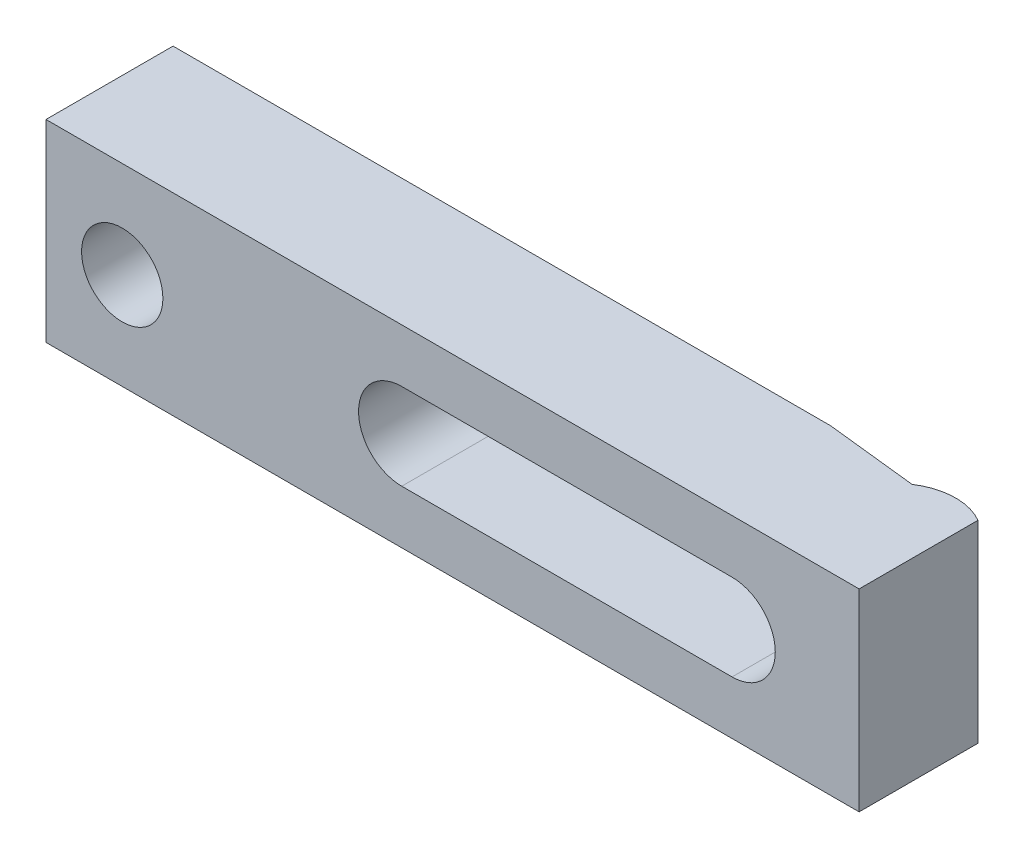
ISO-10303-21;
HEADER;
FILE_DESCRIPTION(('STEP AP214'),'2;1');
FILE_NAME('part.step','',(''),(''),'','','');
FILE_SCHEMA(('AUTOMOTIVE_DESIGN { 1 0 10303 214 1 1 1 1 }'));
ENDSEC;
DATA;
#1=APPLICATION_CONTEXT('core data for automotive mechanical design processes');
#2=APPLICATION_PROTOCOL_DEFINITION('international standard','automotive_design',2000,#1);
#3=PRODUCT_CONTEXT('',#1,'mechanical');
#4=PRODUCT('Part','Part','',(#3));
#5=PRODUCT_RELATED_PRODUCT_CATEGORY('part','',(#4));
#6=PRODUCT_DEFINITION_FORMATION('','',#4);
#7=PRODUCT_DEFINITION_CONTEXT('part definition',#1,'design');
#8=PRODUCT_DEFINITION('design','',#6,#7);
#9=PRODUCT_DEFINITION_SHAPE('','',#8);
#10=(LENGTH_UNIT() NAMED_UNIT(*) SI_UNIT(.MILLI.,.METRE.));
#11=(NAMED_UNIT(*) PLANE_ANGLE_UNIT() SI_UNIT($,.RADIAN.));
#12=(NAMED_UNIT(*) SI_UNIT($,.STERADIAN.) SOLID_ANGLE_UNIT());
#13=UNCERTAINTY_MEASURE_WITH_UNIT(LENGTH_MEASURE(1.E-05),#10,'distance_accuracy_value','');
#14=(GEOMETRIC_REPRESENTATION_CONTEXT(3) GLOBAL_UNCERTAINTY_ASSIGNED_CONTEXT((#13)) GLOBAL_UNIT_ASSIGNED_CONTEXT((#10,
#11,#12)) REPRESENTATION_CONTEXT('',''));
#15=CARTESIAN_POINT('',(0.,0.,0.));
#16=DIRECTION('',(0.,0.,1.));
#17=DIRECTION('',(1.,0.,0.));
#18=AXIS2_PLACEMENT_3D('',#15,#16,#17);
#19=CARTESIAN_POINT('',(-135.,19.,0.));
#20=DIRECTION('',(0.,0.,-1.));
#21=DIRECTION('',(-1.,0.,0.));
#22=AXIS2_PLACEMENT_3D('',#19,#20,#21);
#23=PLANE('',#22);
#24=DIRECTION('',(1.,0.,0.));
#25=VECTOR('',#24,1.);
#26=CARTESIAN_POINT('',(-65.,8.5,0.));
#27=LINE('',#26,#25);
#28=CARTESIAN_POINT('',(-135.,8.5,0.));
#29=VERTEX_POINT('',#28);
#30=CARTESIAN_POINT('',(-5.6,8.5,0.));
#31=VERTEX_POINT('',#30);
#32=EDGE_CURVE('E122',#29,#31,#27,.T.);
#33=ORIENTED_EDGE('',*,*,#32,.F.);
#34=DIRECTION('',(0.,-1.,0.));
#35=VECTOR('',#34,1.);
#36=CARTESIAN_POINT('',(-135.,19.,0.));
#37=LINE('',#36,#35);
#38=CARTESIAN_POINT('',(-135.,19.,0.));
#39=VERTEX_POINT('',#38);
#40=EDGE_CURVE('E139',#39,#29,#37,.T.);
#41=ORIENTED_EDGE('',*,*,#40,.F.);
#42=DIRECTION('',(1.,0.,0.));
#43=VECTOR('',#42,1.);
#44=CARTESIAN_POINT('',(-135.,19.,0.));
#45=LINE('',#44,#43);
#46=CARTESIAN_POINT('',(-5.6,19.,0.));
#47=VERTEX_POINT('',#46);
#48=EDGE_CURVE('E196',#39,#47,#45,.T.);
#49=ORIENTED_EDGE('',*,*,#48,.T.);
#50=DIRECTION('',(0.,-1.,0.));
#51=VECTOR('',#50,1.);
#52=CARTESIAN_POINT('',(-5.6,19.,0.));
#53=LINE('',#52,#51);
#54=EDGE_CURVE('E147',#47,#31,#53,.T.);
#55=ORIENTED_EDGE('',*,*,#54,.T.);
#56=EDGE_LOOP('',(#33,#41,#49,#55));
#57=FACE_BOUND('',#56,.T.);
#58=ADVANCED_FACE('F14',(#57),#23,.T.);
#59=CARTESIAN_POINT('',(-135.,19.,25.));
#60=DIRECTION('',(-1.,0.,0.));
#61=DIRECTION('',(0.,0.,1.));
#62=AXIS2_PLACEMENT_3D('',#59,#60,#61);
#63=PLANE('',#62);
#64=ORIENTED_EDGE('',*,*,#40,.T.);
#65=DIRECTION('',(0.,0.,1.));
#66=VECTOR('',#65,1.);
#67=CARTESIAN_POINT('',(-135.,8.5,25.));
#68=LINE('',#67,#66);
#69=CARTESIAN_POINT('',(-135.,8.5,5.));
#70=VERTEX_POINT('',#69);
#71=EDGE_CURVE('E133',#29,#70,#68,.T.);
#72=ORIENTED_EDGE('',*,*,#71,.T.);
#73=DIRECTION('',(0.,-1.,0.));
#74=VECTOR('',#73,1.);
#75=CARTESIAN_POINT('',(-135.,19.,5.));
#76=LINE('',#75,#74);
#77=CARTESIAN_POINT('',(-135.,-8.5,5.));
#78=VERTEX_POINT('',#77);
#79=EDGE_CURVE('E132',#70,#78,#76,.T.);
#80=ORIENTED_EDGE('',*,*,#79,.T.);
#81=DIRECTION('',(0.,0.,1.));
#82=VECTOR('',#81,1.);
#83=CARTESIAN_POINT('',(-135.,-8.5,25.));
#84=LINE('',#83,#82);
#85=CARTESIAN_POINT('',(-135.,-8.5,0.));
#86=VERTEX_POINT('',#85);
#87=EDGE_CURVE('E113',#86,#78,#84,.T.);
#88=ORIENTED_EDGE('',*,*,#87,.F.);
#89=CARTESIAN_POINT('',(-135.,-19.,0.));
#90=VERTEX_POINT('',#89);
#91=EDGE_CURVE('E129',#86,#90,#37,.T.);
#92=ORIENTED_EDGE('',*,*,#91,.T.);
#93=DIRECTION('',(0.,0.,-1.));
#94=VECTOR('',#93,1.);
#95=CARTESIAN_POINT('',(-135.,-19.,25.));
#96=LINE('',#95,#94);
#97=CARTESIAN_POINT('',(-135.,-19.,25.));
#98=VERTEX_POINT('',#97);
#99=EDGE_CURVE('E169',#98,#90,#96,.T.);
#100=ORIENTED_EDGE('',*,*,#99,.F.);
#101=DIRECTION('',(0.,-1.,0.));
#102=VECTOR('',#101,1.);
#103=CARTESIAN_POINT('',(-135.,19.,25.));
#104=LINE('',#103,#102);
#105=CARTESIAN_POINT('',(-135.,19.,25.));
#106=VERTEX_POINT('',#105);
#107=EDGE_CURVE('E140',#106,#98,#104,.T.);
#108=ORIENTED_EDGE('',*,*,#107,.F.);
#109=DIRECTION('',(0.,0.,-1.));
#110=VECTOR('',#109,1.);
#111=CARTESIAN_POINT('',(-135.,19.,25.));
#112=LINE('',#111,#110);
#113=EDGE_CURVE('E179',#106,#39,#112,.T.);
#114=ORIENTED_EDGE('',*,*,#113,.T.);
#115=EDGE_LOOP('',(#64,#72,#80,#88,#92,#100,#108,#114));
#116=FACE_BOUND('',#115,.T.);
#117=ADVANCED_FACE('F127',(#116),#63,.T.);
#118=CARTESIAN_POINT('',(-65.,0.,25.));
#119=DIRECTION('',(0.,0.,-1.));
#120=DIRECTION('',(-1.,0.,0.));
#121=AXIS2_PLACEMENT_3D('',#118,#119,#120);
#122=CYLINDRICAL_SURFACE('',#121,8.5);
#123=DIRECTION('',(0.,0.,-1.));
#124=VECTOR('',#123,1.);
#125=CARTESIAN_POINT('',(-65.,-8.5,25.));
#126=LINE('',#125,#124);
#127=CARTESIAN_POINT('',(-65.,-8.5,25.));
#128=VERTEX_POINT('',#127);
#129=CARTESIAN_POINT('',(-65.,-8.5,5.));
#130=VERTEX_POINT('',#129);
#131=EDGE_CURVE('E229',#128,#130,#126,.T.);
#132=ORIENTED_EDGE('',*,*,#131,.T.);
#133=CARTESIAN_POINT('',(-65.,0.,5.));
#134=DIRECTION('',(0.,0.,-1.));
#135=DIRECTION('',(-1.,0.,0.));
#136=AXIS2_PLACEMENT_3D('',#133,#134,#135);
#137=CIRCLE('',#136,8.5);
#138=CARTESIAN_POINT('',(-65.,8.5,5.));
#139=VERTEX_POINT('',#138);
#140=EDGE_CURVE('E245',#130,#139,#137,.T.);
#141=ORIENTED_EDGE('',*,*,#140,.T.);
#142=DIRECTION('',(0.,0.,-1.));
#143=VECTOR('',#142,1.);
#144=CARTESIAN_POINT('',(-65.,8.5,25.));
#145=LINE('',#144,#143);
#146=CARTESIAN_POINT('',(-65.,8.5,25.));
#147=VERTEX_POINT('',#146);
#148=EDGE_CURVE('E231',#147,#139,#145,.T.);
#149=ORIENTED_EDGE('',*,*,#148,.F.);
#150=CARTESIAN_POINT('',(-65.,0.,25.));
#151=DIRECTION('',(0.,0.,1.));
#152=DIRECTION('',(1.,0.,0.));
#153=AXIS2_PLACEMENT_3D('',#150,#151,#152);
#154=CIRCLE('',#153,8.5);
#155=EDGE_CURVE('E38',#147,#128,#154,.T.);
#156=ORIENTED_EDGE('',*,*,#155,.T.);
#157=EDGE_LOOP('',(#132,#141,#149,#156));
#158=FACE_BOUND('',#157,.T.);
#159=ADVANCED_FACE('F244',(#158),#122,.F.);
#160=CARTESIAN_POINT('',(-120.,0.,25.));
#161=DIRECTION('',(0.,0.,-1.));
#162=DIRECTION('',(-1.,0.,0.));
#163=AXIS2_PLACEMENT_3D('',#160,#161,#162);
#164=CYLINDRICAL_SURFACE('',#163,8.);
#165=CARTESIAN_POINT('',(-120.,0.,25.));
#166=DIRECTION('',(0.,0.,1.));
#167=DIRECTION('',(1.,0.,0.));
#168=AXIS2_PLACEMENT_3D('',#165,#166,#167);
#169=CIRCLE('',#168,8.);
#170=CARTESIAN_POINT('',(-112.,0.,25.));
#171=VERTEX_POINT('',#170);
#172=EDGE_CURVE('E209',#171,#171,#169,.T.);
#173=ORIENTED_EDGE('',*,*,#172,.T.);
#174=EDGE_LOOP('',(#173));
#175=FACE_BOUND('',#174,.T.);
#176=CARTESIAN_POINT('',(-120.,0.,5.));
#177=DIRECTION('',(0.,0.,-1.));
#178=DIRECTION('',(-1.,0.,0.));
#179=AXIS2_PLACEMENT_3D('',#176,#177,#178);
#180=CIRCLE('',#179,8.);
#181=CARTESIAN_POINT('',(-128.,0.,5.));
#182=VERTEX_POINT('',#181);
#183=EDGE_CURVE('E18',#182,#182,#180,.T.);
#184=ORIENTED_EDGE('',*,*,#183,.T.);
#185=EDGE_LOOP('',(#184));
#186=FACE_BOUND('',#185,.T.);
#187=ADVANCED_FACE('F278',(#175,#186),#164,.F.);
#188=CARTESIAN_POINT('',(25.,19.,25.));
#189=DIRECTION('',(0.,0.,1.));
#190=DIRECTION('',(1.,0.,0.));
#191=AXIS2_PLACEMENT_3D('',#188,#189,#190);
#192=PLANE('',#191);
#193=DIRECTION('',(1.,0.,0.));
#194=VECTOR('',#193,1.);
#195=CARTESIAN_POINT('',(-65.,8.5,25.));
#196=LINE('',#195,#194);
#197=CARTESIAN_POINT('',(0.,8.5,25.));
#198=VERTEX_POINT('',#197);
#199=EDGE_CURVE('E223',#147,#198,#196,.T.);
#200=ORIENTED_EDGE('',*,*,#199,.T.);
#201=CARTESIAN_POINT('',(0.,0.,25.));
#202=DIRECTION('',(0.,0.,1.));
#203=DIRECTION('',(1.,0.,0.));
#204=AXIS2_PLACEMENT_3D('',#201,#202,#203);
#205=CIRCLE('',#204,8.5);
#206=CARTESIAN_POINT('',(0.,-8.5,25.));
#207=VERTEX_POINT('',#206);
#208=EDGE_CURVE('E121',#207,#198,#205,.T.);
#209=ORIENTED_EDGE('',*,*,#208,.F.);
#210=DIRECTION('',(-1.,0.,0.));
#211=VECTOR('',#210,1.);
#212=CARTESIAN_POINT('',(0.,-8.5,25.));
#213=LINE('',#212,#211);
#214=EDGE_CURVE('E218',#207,#128,#213,.T.);
#215=ORIENTED_EDGE('',*,*,#214,.T.);
#216=ORIENTED_EDGE('',*,*,#155,.F.);
#217=EDGE_LOOP('',(#200,#209,#215,#216));
#218=FACE_BOUND('',#217,.T.);
#219=DIRECTION('',(0.,-1.,0.));
#220=VECTOR('',#219,1.);
#221=CARTESIAN_POINT('',(25.,19.,25.));
#222=LINE('',#221,#220);
#223=CARTESIAN_POINT('',(25.,19.,25.));
#224=VERTEX_POINT('',#223);
#225=CARTESIAN_POINT('',(25.,-19.,25.));
#226=VERTEX_POINT('',#225);
#227=EDGE_CURVE('E23',#224,#226,#222,.T.);
#228=ORIENTED_EDGE('',*,*,#227,.F.);
#229=DIRECTION('',(-1.,0.,0.));
#230=VECTOR('',#229,1.);
#231=CARTESIAN_POINT('',(25.,19.,25.));
#232=LINE('',#231,#230);
#233=EDGE_CURVE('E177',#224,#106,#232,.T.);
#234=ORIENTED_EDGE('',*,*,#233,.T.);
#235=ORIENTED_EDGE('',*,*,#107,.T.);
#236=DIRECTION('',(-1.,0.,0.));
#237=VECTOR('',#236,1.);
#238=CARTESIAN_POINT('',(25.,-19.,25.));
#239=LINE('',#238,#237);
#240=EDGE_CURVE('E165',#226,#98,#239,.T.);
#241=ORIENTED_EDGE('',*,*,#240,.F.);
#242=EDGE_LOOP('',(#228,#234,#235,#241));
#243=FACE_BOUND('',#242,.T.);
#244=ORIENTED_EDGE('',*,*,#172,.F.);
#245=EDGE_LOOP('',(#244));
#246=FACE_BOUND('',#245,.T.);
#247=ADVANCED_FACE('F166',(#218,#243,#246),#192,.T.);
#248=ORIENTED_EDGE('',*,*,#91,.F.);
#249=DIRECTION('',(-1.,0.,0.));
#250=VECTOR('',#249,1.);
#251=CARTESIAN_POINT('',(0.,-8.5,0.));
#252=LINE('',#251,#250);
#253=CARTESIAN_POINT('',(-5.6,-8.5,0.));
#254=VERTEX_POINT('',#253);
#255=EDGE_CURVE('E109',#254,#86,#252,.T.);
#256=ORIENTED_EDGE('',*,*,#255,.F.);
#257=CARTESIAN_POINT('',(-5.6,-19.,0.));
#258=VERTEX_POINT('',#257);
#259=EDGE_CURVE('E142',#254,#258,#53,.T.);
#260=ORIENTED_EDGE('',*,*,#259,.T.);
#261=DIRECTION('',(1.,0.,0.));
#262=VECTOR('',#261,1.);
#263=CARTESIAN_POINT('',(-135.,-19.,0.));
#264=LINE('',#263,#262);
#265=EDGE_CURVE('E138',#90,#258,#264,.T.);
#266=ORIENTED_EDGE('',*,*,#265,.F.);
#267=EDGE_LOOP('',(#248,#256,#260,#266));
#268=FACE_BOUND('',#267,.T.);
#269=ADVANCED_FACE('F136',(#268),#23,.T.);
#270=CARTESIAN_POINT('',(25.,19.,25.));
#271=DIRECTION('',(-1.,0.,0.));
#272=DIRECTION('',(0.,0.,1.));
#273=AXIS2_PLACEMENT_3D('',#270,#271,#272);
#274=PLANE('',#273);
#275=DIRECTION('',(0.,-1.,0.));
#276=VECTOR('',#275,1.);
#277=CARTESIAN_POINT('',(25.,19.,1.60769515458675));
#278=LINE('',#277,#276);
#279=CARTESIAN_POINT('',(25.,19.,1.60769515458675));
#280=VERTEX_POINT('',#279);
#281=CARTESIAN_POINT('',(25.,-19.,1.60769515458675));
#282=VERTEX_POINT('',#281);
#283=EDGE_CURVE('E152',#280,#282,#278,.T.);
#284=ORIENTED_EDGE('',*,*,#283,.F.);
#285=DIRECTION('',(0.,0.,-1.));
#286=VECTOR('',#285,1.);
#287=CARTESIAN_POINT('',(25.,19.,25.));
#288=LINE('',#287,#286);
#289=EDGE_CURVE('E143',#224,#280,#288,.T.);
#290=ORIENTED_EDGE('',*,*,#289,.F.);
#291=ORIENTED_EDGE('',*,*,#227,.T.);
#292=DIRECTION('',(0.,0.,-1.));
#293=VECTOR('',#292,1.);
#294=CARTESIAN_POINT('',(25.,-19.,25.));
#295=LINE('',#294,#293);
#296=EDGE_CURVE('E159',#226,#282,#295,.T.);
#297=ORIENTED_EDGE('',*,*,#296,.T.);
#298=EDGE_LOOP('',(#284,#290,#291,#297));
#299=FACE_BOUND('',#298,.T.);
#300=ADVANCED_FACE('F16',(#299),#274,.F.);
#301=CARTESIAN_POINT('',(19.,19.,12.));
#302=DIRECTION('',(0.,-1.,0.));
#303=DIRECTION('',(0.,0.,-1.));
#304=AXIS2_PLACEMENT_3D('',#301,#302,#303);
#305=CYLINDRICAL_SURFACE('',#304,12.);
#306=DIRECTION('',(0.,-1.,0.));
#307=VECTOR('',#306,1.);
#308=CARTESIAN_POINT('',(12.4,19.,1.97802414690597));
#309=LINE('',#308,#307);
#310=CARTESIAN_POINT('',(12.4,19.,1.97802414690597));
#311=VERTEX_POINT('',#310);
#312=CARTESIAN_POINT('',(12.4,-19.,1.97802414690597));
#313=VERTEX_POINT('',#312);
#314=EDGE_CURVE('E150',#311,#313,#309,.T.);
#315=ORIENTED_EDGE('',*,*,#314,.F.);
#316=CARTESIAN_POINT('',(19.,19.,12.));
#317=DIRECTION('',(0.,1.,0.));
#318=DIRECTION('',(0.,0.,1.));
#319=AXIS2_PLACEMENT_3D('',#316,#317,#318);
#320=CIRCLE('',#319,12.);
#321=EDGE_CURVE('E190',#280,#311,#320,.T.);
#322=ORIENTED_EDGE('',*,*,#321,.F.);
#323=ORIENTED_EDGE('',*,*,#283,.T.);
#324=CARTESIAN_POINT('',(19.,-19.,12.));
#325=DIRECTION('',(0.,1.,0.));
#326=DIRECTION('',(0.,0.,1.));
#327=AXIS2_PLACEMENT_3D('',#324,#325,#326);
#328=CIRCLE('',#327,12.);
#329=EDGE_CURVE('E176',#282,#313,#328,.T.);
#330=ORIENTED_EDGE('',*,*,#329,.T.);
#331=EDGE_LOOP('',(#315,#322,#323,#330));
#332=FACE_BOUND('',#331,.T.);
#333=ADVANCED_FACE('F277',(#332),#305,.T.);
#334=CARTESIAN_POINT('',(12.4,19.,1.97802414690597));
#335=DIRECTION('',(-0.109232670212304,0.,0.99401620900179));
#336=DIRECTION('',(0.99401620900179,0.,0.109232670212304));
#337=AXIS2_PLACEMENT_3D('',#334,#335,#336);
#338=PLANE('',#337);
#339=CARTESIAN_POINT('',(0.,0.,0.615385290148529));
#340=DIRECTION('',(-0.109232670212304,0.,0.99401620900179));
#341=DIRECTION('',(-0.99401620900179,0.,-0.109232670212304));
#342=AXIS2_PLACEMENT_3D('',#339,#340,#341);
#343=ELLIPSE('',#342,8.55116840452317,8.5);
#344=CARTESIAN_POINT('',(0.,8.5,0.61538529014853));
#345=VERTEX_POINT('',#344);
#346=CARTESIAN_POINT('',(0.,-8.5,0.61538529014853));
#347=VERTEX_POINT('',#346);
#348=EDGE_CURVE('E9',#345,#347,#343,.F.);
#349=ORIENTED_EDGE('',*,*,#348,.F.);
#350=DIRECTION('',(-0.99401620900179,0.,-0.109232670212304));
#351=VECTOR('',#350,1.);
#352=CARTESIAN_POINT('',(12.4,8.5,1.97802414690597));
#353=LINE('',#352,#351);
#354=EDGE_CURVE('E170',#345,#31,#353,.T.);
#355=ORIENTED_EDGE('',*,*,#354,.T.);
#356=ORIENTED_EDGE('',*,*,#54,.F.);
#357=DIRECTION('',(-0.99401620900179,0.,-0.109232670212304));
#358=VECTOR('',#357,1.);
#359=CARTESIAN_POINT('',(12.4,19.,1.97802414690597));
#360=LINE('',#359,#358);
#361=EDGE_CURVE('E193',#311,#47,#360,.T.);
#362=ORIENTED_EDGE('',*,*,#361,.F.);
#363=ORIENTED_EDGE('',*,*,#314,.T.);
#364=DIRECTION('',(-0.99401620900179,0.,-0.109232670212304));
#365=VECTOR('',#364,1.);
#366=CARTESIAN_POINT('',(12.4,-19.,1.97802414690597));
#367=LINE('',#366,#365);
#368=EDGE_CURVE('E180',#313,#258,#367,.T.);
#369=ORIENTED_EDGE('',*,*,#368,.T.);
#370=ORIENTED_EDGE('',*,*,#259,.F.);
#371=DIRECTION('',(0.99401620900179,0.,0.109232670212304));
#372=VECTOR('',#371,1.);
#373=CARTESIAN_POINT('',(12.4,-8.5,1.97802414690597));
#374=LINE('',#373,#372);
#375=EDGE_CURVE('E117',#254,#347,#374,.T.);
#376=ORIENTED_EDGE('',*,*,#375,.T.);
#377=EDGE_LOOP('',(#349,#355,#356,#362,#363,#369,#370,#376));
#378=FACE_BOUND('',#377,.T.);
#379=ADVANCED_FACE('F237',(#378),#338,.F.);
#380=CARTESIAN_POINT('',(19.,19.,12.));
#381=DIRECTION('',(0.,1.,0.));
#382=DIRECTION('',(0.,0.,1.));
#383=AXIS2_PLACEMENT_3D('',#380,#381,#382);
#384=PLANE('',#383);
#385=ORIENTED_EDGE('',*,*,#233,.F.);
#386=ORIENTED_EDGE('',*,*,#289,.T.);
#387=ORIENTED_EDGE('',*,*,#321,.T.);
#388=ORIENTED_EDGE('',*,*,#361,.T.);
#389=ORIENTED_EDGE('',*,*,#48,.F.);
#390=ORIENTED_EDGE('',*,*,#113,.F.);
#391=EDGE_LOOP('',(#385,#386,#387,#388,#389,#390));
#392=FACE_BOUND('',#391,.T.);
#393=ADVANCED_FACE('F203',(#392),#384,.T.);
#394=CARTESIAN_POINT('',(19.,-19.,12.));
#395=DIRECTION('',(0.,1.,0.));
#396=DIRECTION('',(0.,0.,1.));
#397=AXIS2_PLACEMENT_3D('',#394,#395,#396);
#398=PLANE('',#397);
#399=ORIENTED_EDGE('',*,*,#240,.T.);
#400=ORIENTED_EDGE('',*,*,#99,.T.);
#401=ORIENTED_EDGE('',*,*,#265,.T.);
#402=ORIENTED_EDGE('',*,*,#368,.F.);
#403=ORIENTED_EDGE('',*,*,#329,.F.);
#404=ORIENTED_EDGE('',*,*,#296,.F.);
#405=EDGE_LOOP('',(#399,#400,#401,#402,#403,#404));
#406=FACE_BOUND('',#405,.T.);
#407=ADVANCED_FACE('F173',(#406),#398,.F.);
#408=CARTESIAN_POINT('',(0.,0.,25.));
#409=DIRECTION('',(0.,0.,-1.));
#410=DIRECTION('',(-1.,0.,0.));
#411=AXIS2_PLACEMENT_3D('',#408,#409,#410);
#412=CYLINDRICAL_SURFACE('',#411,8.5);
#413=ORIENTED_EDGE('',*,*,#348,.T.);
#414=DIRECTION('',(0.,0.,-1.));
#415=VECTOR('',#414,1.);
#416=CARTESIAN_POINT('',(0.,-8.5,25.));
#417=LINE('',#416,#415);
#418=EDGE_CURVE('E221',#207,#347,#417,.T.);
#419=ORIENTED_EDGE('',*,*,#418,.F.);
#420=ORIENTED_EDGE('',*,*,#208,.T.);
#421=DIRECTION('',(0.,0.,-1.));
#422=VECTOR('',#421,1.);
#423=CARTESIAN_POINT('',(0.,8.5,25.));
#424=LINE('',#423,#422);
#425=EDGE_CURVE('E233',#198,#345,#424,.T.);
#426=ORIENTED_EDGE('',*,*,#425,.T.);
#427=EDGE_LOOP('',(#413,#419,#420,#426));
#428=FACE_BOUND('',#427,.T.);
#429=ADVANCED_FACE('F240',(#428),#412,.F.);
#430=CARTESIAN_POINT('',(-65.,8.5,25.));
#431=DIRECTION('',(0.,1.,0.));
#432=DIRECTION('',(0.,0.,1.));
#433=AXIS2_PLACEMENT_3D('',#430,#431,#432);
#434=PLANE('',#433);
#435=ORIENTED_EDGE('',*,*,#32,.T.);
#436=ORIENTED_EDGE('',*,*,#354,.F.);
#437=ORIENTED_EDGE('',*,*,#425,.F.);
#438=ORIENTED_EDGE('',*,*,#199,.F.);
#439=ORIENTED_EDGE('',*,*,#148,.T.);
#440=DIRECTION('',(-1.,0.,0.));
#441=VECTOR('',#440,1.);
#442=CARTESIAN_POINT('',(-15.,8.5,5.));
#443=LINE('',#442,#441);
#444=EDGE_CURVE('E30',#139,#70,#443,.T.);
#445=ORIENTED_EDGE('',*,*,#444,.T.);
#446=ORIENTED_EDGE('',*,*,#71,.F.);
#447=EDGE_LOOP('',(#435,#436,#437,#438,#439,#445,#446));
#448=FACE_BOUND('',#447,.T.);
#449=ADVANCED_FACE('F211',(#448),#434,.F.);
#450=CARTESIAN_POINT('',(0.,-8.5,25.));
#451=DIRECTION('',(0.,-1.,0.));
#452=DIRECTION('',(1.,0.,0.));
#453=AXIS2_PLACEMENT_3D('',#450,#451,#452);
#454=PLANE('',#453);
#455=ORIENTED_EDGE('',*,*,#255,.T.);
#456=ORIENTED_EDGE('',*,*,#87,.T.);
#457=DIRECTION('',(-1.,0.,0.));
#458=VECTOR('',#457,1.);
#459=CARTESIAN_POINT('',(-15.,-8.5,5.));
#460=LINE('',#459,#458);
#461=EDGE_CURVE('E249',#130,#78,#460,.T.);
#462=ORIENTED_EDGE('',*,*,#461,.F.);
#463=ORIENTED_EDGE('',*,*,#131,.F.);
#464=ORIENTED_EDGE('',*,*,#214,.F.);
#465=ORIENTED_EDGE('',*,*,#418,.T.);
#466=ORIENTED_EDGE('',*,*,#375,.F.);
#467=EDGE_LOOP('',(#455,#456,#462,#463,#464,#465,#466));
#468=FACE_BOUND('',#467,.T.);
#469=ADVANCED_FACE('F111',(#468),#454,.F.);
#470=CARTESIAN_POINT('',(-15.,8.5,5.));
#471=DIRECTION('',(0.,0.,-1.));
#472=DIRECTION('',(-1.,0.,0.));
#473=AXIS2_PLACEMENT_3D('',#470,#471,#472);
#474=PLANE('',#473);
#475=ORIENTED_EDGE('',*,*,#183,.F.);
#476=EDGE_LOOP('',(#475));
#477=FACE_BOUND('',#476,.T.);
#478=ORIENTED_EDGE('',*,*,#444,.F.);
#479=ORIENTED_EDGE('',*,*,#140,.F.);
#480=ORIENTED_EDGE('',*,*,#461,.T.);
#481=ORIENTED_EDGE('',*,*,#79,.F.);
#482=EDGE_LOOP('',(#478,#479,#480,#481));
#483=FACE_BOUND('',#482,.T.);
#484=ADVANCED_FACE('F251',(#477,#483),#474,.T.);
#485=CLOSED_SHELL('',(#58,#117,#159,#187,#247,#269,#300,#333,#379,#393,#407,#429,#449,#469,#484));
#486=MANIFOLD_SOLID_BREP('B1',#485);
#487=ADVANCED_BREP_SHAPE_REPRESENTATION('',(#18,#486),#14);
#488=SHAPE_DEFINITION_REPRESENTATION(#9,#487);
ENDSEC;
END-ISO-10303-21;
